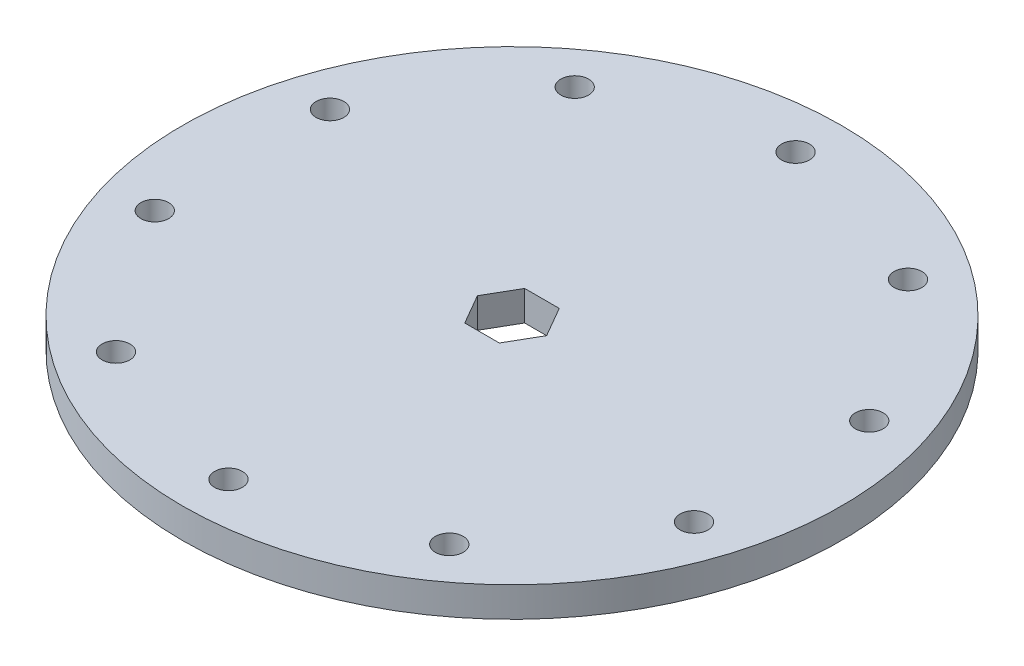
ISO-10303-21;
HEADER;
FILE_DESCRIPTION(('STEP AP214'),'2;1');
FILE_NAME('part.step','',(''),(''),'','','');
FILE_SCHEMA(('AUTOMOTIVE_DESIGN { 1 0 10303 214 1 1 1 1 }'));
ENDSEC;
DATA;
#1=APPLICATION_CONTEXT('core data for automotive mechanical design processes');
#2=APPLICATION_PROTOCOL_DEFINITION('international standard','automotive_design',2000,#1);
#3=PRODUCT_CONTEXT('',#1,'mechanical');
#4=PRODUCT('Part','Part','',(#3));
#5=PRODUCT_RELATED_PRODUCT_CATEGORY('part','',(#4));
#6=PRODUCT_DEFINITION_FORMATION('','',#4);
#7=PRODUCT_DEFINITION_CONTEXT('part definition',#1,'design');
#8=PRODUCT_DEFINITION('design','',#6,#7);
#9=PRODUCT_DEFINITION_SHAPE('','',#8);
#10=(LENGTH_UNIT() NAMED_UNIT(*) SI_UNIT(.MILLI.,.METRE.));
#11=(NAMED_UNIT(*) PLANE_ANGLE_UNIT() SI_UNIT($,.RADIAN.));
#12=(NAMED_UNIT(*) SI_UNIT($,.STERADIAN.) SOLID_ANGLE_UNIT());
#13=UNCERTAINTY_MEASURE_WITH_UNIT(LENGTH_MEASURE(1.E-05),#10,'distance_accuracy_value','');
#14=(GEOMETRIC_REPRESENTATION_CONTEXT(3) GLOBAL_UNCERTAINTY_ASSIGNED_CONTEXT((#13)) GLOBAL_UNIT_ASSIGNED_CONTEXT((#10,
#11,#12)) REPRESENTATION_CONTEXT('',''));
#15=CARTESIAN_POINT('',(0.,0.,0.));
#16=DIRECTION('',(0.,0.,1.));
#17=DIRECTION('',(1.,0.,0.));
#18=AXIS2_PLACEMENT_3D('',#15,#16,#17);
#19=CARTESIAN_POINT('',(0.,3.175,0.));
#20=DIRECTION('',(0.,1.,0.));
#21=DIRECTION('',(0.,0.,1.));
#22=AXIS2_PLACEMENT_3D('',#19,#20,#21);
#23=PLANE('',#22);
#24=CARTESIAN_POINT('',(0.,3.175,-30.0455330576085));
#25=DIRECTION('',(0.,1.,0.));
#26=DIRECTION('',(0.,0.,1.));
#27=AXIS2_PLACEMENT_3D('',#24,#25,#26);
#28=CIRCLE('',#27,1.4732);
#29=CARTESIAN_POINT('',(0.,3.175,-28.5723330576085));
#30=VERTEX_POINT('',#29);
#31=EDGE_CURVE('E319',#30,#30,#28,.T.);
#32=ORIENTED_EDGE('',*,*,#31,.F.);
#33=EDGE_LOOP('',(#32));
#34=FACE_BOUND('',#33,.T.);
#35=CARTESIAN_POINT('',(-17.6603212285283,3.175,-24.3073468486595));
#36=DIRECTION('',(0.,1.,0.));
#37=DIRECTION('',(0.,0.,1.));
#38=AXIS2_PLACEMENT_3D('',#35,#36,#37);
#39=CIRCLE('',#38,1.4732);
#40=CARTESIAN_POINT('',(-17.6603212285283,3.175,-22.8341468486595));
#41=VERTEX_POINT('',#40);
#42=EDGE_CURVE('E321',#41,#41,#39,.T.);
#43=ORIENTED_EDGE('',*,*,#42,.F.);
#44=EDGE_LOOP('',(#43));
#45=FACE_BOUND('',#44,.T.);
#46=CARTESIAN_POINT('',(-28.575,3.175,-9.28458031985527));
#47=DIRECTION('',(0.,1.,0.));
#48=DIRECTION('',(0.,0.,1.));
#49=AXIS2_PLACEMENT_3D('',#46,#47,#48);
#50=CIRCLE('',#49,1.4732);
#51=CARTESIAN_POINT('',(-28.575,3.175,-7.81138031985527));
#52=VERTEX_POINT('',#51);
#53=EDGE_CURVE('E329',#52,#52,#50,.T.);
#54=ORIENTED_EDGE('',*,*,#53,.F.);
#55=EDGE_LOOP('',(#54));
#56=FACE_BOUND('',#55,.T.);
#57=CARTESIAN_POINT('',(-28.575,3.175,9.28458031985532));
#58=DIRECTION('',(0.,1.,0.));
#59=DIRECTION('',(0.,0.,1.));
#60=AXIS2_PLACEMENT_3D('',#57,#58,#59);
#61=CIRCLE('',#60,1.4732);
#62=CARTESIAN_POINT('',(-28.575,3.175,10.7577803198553));
#63=VERTEX_POINT('',#62);
#64=EDGE_CURVE('E335',#63,#63,#61,.T.);
#65=ORIENTED_EDGE('',*,*,#64,.F.);
#66=EDGE_LOOP('',(#65));
#67=FACE_BOUND('',#66,.T.);
#68=CARTESIAN_POINT('',(-17.6603212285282,3.175,24.3073468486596));
#69=DIRECTION('',(0.,1.,0.));
#70=DIRECTION('',(0.,0.,1.));
#71=AXIS2_PLACEMENT_3D('',#68,#69,#70);
#72=CIRCLE('',#71,1.4732);
#73=CARTESIAN_POINT('',(-17.6603212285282,3.175,25.7805468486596));
#74=VERTEX_POINT('',#73);
#75=EDGE_CURVE('E341',#74,#74,#72,.T.);
#76=ORIENTED_EDGE('',*,*,#75,.F.);
#77=EDGE_LOOP('',(#76));
#78=FACE_BOUND('',#77,.T.);
#79=CARTESIAN_POINT('',(0.,3.175,30.0455330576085));
#80=DIRECTION('',(0.,1.,0.));
#81=DIRECTION('',(0.,0.,1.));
#82=AXIS2_PLACEMENT_3D('',#79,#80,#81);
#83=CIRCLE('',#82,1.4732);
#84=CARTESIAN_POINT('',(0.,3.175,31.5187330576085));
#85=VERTEX_POINT('',#84);
#86=EDGE_CURVE('E347',#85,#85,#83,.T.);
#87=ORIENTED_EDGE('',*,*,#86,.F.);
#88=EDGE_LOOP('',(#87));
#89=FACE_BOUND('',#88,.T.);
#90=CARTESIAN_POINT('',(17.6603212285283,3.175,24.3073468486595));
#91=DIRECTION('',(0.,1.,0.));
#92=DIRECTION('',(0.,0.,1.));
#93=AXIS2_PLACEMENT_3D('',#90,#91,#92);
#94=CIRCLE('',#93,1.4732);
#95=CARTESIAN_POINT('',(17.6603212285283,3.175,25.7805468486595));
#96=VERTEX_POINT('',#95);
#97=EDGE_CURVE('E353',#96,#96,#94,.T.);
#98=ORIENTED_EDGE('',*,*,#97,.F.);
#99=EDGE_LOOP('',(#98));
#100=FACE_BOUND('',#99,.T.);
#101=CARTESIAN_POINT('',(28.575,3.175,9.28458031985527));
#102=DIRECTION('',(0.,1.,0.));
#103=DIRECTION('',(0.,0.,1.));
#104=AXIS2_PLACEMENT_3D('',#101,#102,#103);
#105=CIRCLE('',#104,1.4732);
#106=CARTESIAN_POINT('',(28.575,3.175,10.7577803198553));
#107=VERTEX_POINT('',#106);
#108=EDGE_CURVE('E359',#107,#107,#105,.T.);
#109=ORIENTED_EDGE('',*,*,#108,.F.);
#110=EDGE_LOOP('',(#109));
#111=FACE_BOUND('',#110,.T.);
#112=CARTESIAN_POINT('',(28.575,3.175,-9.28458031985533));
#113=DIRECTION('',(0.,1.,0.));
#114=DIRECTION('',(0.,0.,1.));
#115=AXIS2_PLACEMENT_3D('',#112,#113,#114);
#116=CIRCLE('',#115,1.4732);
#117=CARTESIAN_POINT('',(28.575,3.175,-7.81138031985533));
#118=VERTEX_POINT('',#117);
#119=EDGE_CURVE('E365',#118,#118,#116,.T.);
#120=ORIENTED_EDGE('',*,*,#119,.F.);
#121=EDGE_LOOP('',(#120));
#122=FACE_BOUND('',#121,.T.);
#123=CARTESIAN_POINT('',(17.6603212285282,3.175,-24.3073468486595));
#124=DIRECTION('',(0.,1.,0.));
#125=DIRECTION('',(0.,0.,1.));
#126=AXIS2_PLACEMENT_3D('',#123,#124,#125);
#127=CIRCLE('',#126,1.4732);
#128=CARTESIAN_POINT('',(17.6603212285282,3.175,-22.8341468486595));
#129=VERTEX_POINT('',#128);
#130=EDGE_CURVE('E371',#129,#129,#127,.T.);
#131=ORIENTED_EDGE('',*,*,#130,.F.);
#132=EDGE_LOOP('',(#131));
#133=FACE_BOUND('',#132,.T.);
#134=CARTESIAN_POINT('',(0.,3.175,0.));
#135=DIRECTION('',(0.,1.,0.));
#136=DIRECTION('',(0.,0.,1.));
#137=AXIS2_PLACEMENT_3D('',#134,#135,#136);
#138=CIRCLE('',#137,34.925);
#139=CARTESIAN_POINT('',(0.,3.175,34.925));
#140=VERTEX_POINT('',#139);
#141=EDGE_CURVE('E11',#140,#140,#138,.T.);
#142=ORIENTED_EDGE('',*,*,#141,.T.);
#143=EDGE_LOOP('',(#142));
#144=FACE_BOUND('',#143,.T.);
#145=DIRECTION('',(-1.,0.,0.));
#146=VECTOR('',#145,1.);
#147=CARTESIAN_POINT('',(1.83308710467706,3.175,-3.175));
#148=LINE('',#147,#146);
#149=CARTESIAN_POINT('',(1.83308710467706,3.175,-3.175));
#150=VERTEX_POINT('',#149);
#151=CARTESIAN_POINT('',(-1.83308710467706,3.175,-3.175));
#152=VERTEX_POINT('',#151);
#153=EDGE_CURVE('E93',#150,#152,#148,.T.);
#154=ORIENTED_EDGE('',*,*,#153,.F.);
#155=DIRECTION('',(-0.5,0.,-0.866025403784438));
#156=VECTOR('',#155,1.);
#157=CARTESIAN_POINT('',(3.66617420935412,3.175,0.));
#158=LINE('',#157,#156);
#159=CARTESIAN_POINT('',(3.66617420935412,3.175,0.));
#160=VERTEX_POINT('',#159);
#161=EDGE_CURVE('E85',#160,#150,#158,.T.);
#162=ORIENTED_EDGE('',*,*,#161,.F.);
#163=DIRECTION('',(0.5,0.,-0.866025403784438));
#164=VECTOR('',#163,1.);
#165=CARTESIAN_POINT('',(1.83308710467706,3.175,3.175));
#166=LINE('',#165,#164);
#167=CARTESIAN_POINT('',(1.83308710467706,3.175,3.175));
#168=VERTEX_POINT('',#167);
#169=EDGE_CURVE('E114',#168,#160,#166,.T.);
#170=ORIENTED_EDGE('',*,*,#169,.F.);
#171=DIRECTION('',(1.,0.,0.));
#172=VECTOR('',#171,1.);
#173=CARTESIAN_POINT('',(-1.83308710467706,3.175,3.175));
#174=LINE('',#173,#172);
#175=CARTESIAN_POINT('',(-1.83308710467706,3.175,3.175));
#176=VERTEX_POINT('',#175);
#177=EDGE_CURVE('E112',#176,#168,#174,.T.);
#178=ORIENTED_EDGE('',*,*,#177,.F.);
#179=DIRECTION('',(0.5,0.,0.866025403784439));
#180=VECTOR('',#179,1.);
#181=CARTESIAN_POINT('',(-3.66617420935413,3.175,0.));
#182=LINE('',#181,#180);
#183=CARTESIAN_POINT('',(-3.66617420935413,3.175,0.));
#184=VERTEX_POINT('',#183);
#185=EDGE_CURVE('E107',#184,#176,#182,.T.);
#186=ORIENTED_EDGE('',*,*,#185,.F.);
#187=DIRECTION('',(-0.5,0.,0.866025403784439));
#188=VECTOR('',#187,1.);
#189=CARTESIAN_POINT('',(-1.83308710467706,3.175,-3.175));
#190=LINE('',#189,#188);
#191=EDGE_CURVE('E105',#152,#184,#190,.T.);
#192=ORIENTED_EDGE('',*,*,#191,.F.);
#193=EDGE_LOOP('',(#154,#162,#170,#178,#186,#192));
#194=FACE_BOUND('',#193,.T.);
#195=ADVANCED_FACE('F32',(#34,#45,#56,#67,#78,#89,#100,#111,#122,#133,#144,#194),#23,.T.);
#196=CARTESIAN_POINT('',(0.,0.,0.));
#197=DIRECTION('',(0.,1.,0.));
#198=DIRECTION('',(0.,0.,1.));
#199=AXIS2_PLACEMENT_3D('',#196,#197,#198);
#200=PLANE('',#199);
#201=CARTESIAN_POINT('',(0.,0.,-30.0455330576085));
#202=DIRECTION('',(0.,1.,0.));
#203=DIRECTION('',(0.,0.,1.));
#204=AXIS2_PLACEMENT_3D('',#201,#202,#203);
#205=CIRCLE('',#204,1.4732);
#206=CARTESIAN_POINT('',(0.,0.,-28.5723330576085));
#207=VERTEX_POINT('',#206);
#208=EDGE_CURVE('E317',#207,#207,#205,.T.);
#209=ORIENTED_EDGE('',*,*,#208,.T.);
#210=EDGE_LOOP('',(#209));
#211=FACE_BOUND('',#210,.T.);
#212=CARTESIAN_POINT('',(-17.6603212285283,0.,-24.3073468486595));
#213=DIRECTION('',(0.,1.,0.));
#214=DIRECTION('',(0.,0.,1.));
#215=AXIS2_PLACEMENT_3D('',#212,#213,#214);
#216=CIRCLE('',#215,1.4732);
#217=CARTESIAN_POINT('',(-17.6603212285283,0.,-22.8341468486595));
#218=VERTEX_POINT('',#217);
#219=EDGE_CURVE('E326',#218,#218,#216,.T.);
#220=ORIENTED_EDGE('',*,*,#219,.T.);
#221=EDGE_LOOP('',(#220));
#222=FACE_BOUND('',#221,.T.);
#223=CARTESIAN_POINT('',(-28.575,0.,-9.28458031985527));
#224=DIRECTION('',(0.,1.,0.));
#225=DIRECTION('',(0.,0.,1.));
#226=AXIS2_PLACEMENT_3D('',#223,#224,#225);
#227=CIRCLE('',#226,1.4732);
#228=CARTESIAN_POINT('',(-28.575,0.,-7.81138031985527));
#229=VERTEX_POINT('',#228);
#230=EDGE_CURVE('E332',#229,#229,#227,.T.);
#231=ORIENTED_EDGE('',*,*,#230,.T.);
#232=EDGE_LOOP('',(#231));
#233=FACE_BOUND('',#232,.T.);
#234=CARTESIAN_POINT('',(-28.575,0.,9.28458031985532));
#235=DIRECTION('',(0.,1.,0.));
#236=DIRECTION('',(0.,0.,1.));
#237=AXIS2_PLACEMENT_3D('',#234,#235,#236);
#238=CIRCLE('',#237,1.4732);
#239=CARTESIAN_POINT('',(-28.575,0.,10.7577803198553));
#240=VERTEX_POINT('',#239);
#241=EDGE_CURVE('E338',#240,#240,#238,.T.);
#242=ORIENTED_EDGE('',*,*,#241,.T.);
#243=EDGE_LOOP('',(#242));
#244=FACE_BOUND('',#243,.T.);
#245=CARTESIAN_POINT('',(-17.6603212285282,0.,24.3073468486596));
#246=DIRECTION('',(0.,1.,0.));
#247=DIRECTION('',(0.,0.,1.));
#248=AXIS2_PLACEMENT_3D('',#245,#246,#247);
#249=CIRCLE('',#248,1.4732);
#250=CARTESIAN_POINT('',(-17.6603212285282,0.,25.7805468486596));
#251=VERTEX_POINT('',#250);
#252=EDGE_CURVE('E344',#251,#251,#249,.T.);
#253=ORIENTED_EDGE('',*,*,#252,.T.);
#254=EDGE_LOOP('',(#253));
#255=FACE_BOUND('',#254,.T.);
#256=CARTESIAN_POINT('',(0.,0.,30.0455330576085));
#257=DIRECTION('',(0.,1.,0.));
#258=DIRECTION('',(0.,0.,1.));
#259=AXIS2_PLACEMENT_3D('',#256,#257,#258);
#260=CIRCLE('',#259,1.4732);
#261=CARTESIAN_POINT('',(0.,0.,31.5187330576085));
#262=VERTEX_POINT('',#261);
#263=EDGE_CURVE('E350',#262,#262,#260,.T.);
#264=ORIENTED_EDGE('',*,*,#263,.T.);
#265=EDGE_LOOP('',(#264));
#266=FACE_BOUND('',#265,.T.);
#267=CARTESIAN_POINT('',(17.6603212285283,0.,24.3073468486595));
#268=DIRECTION('',(0.,1.,0.));
#269=DIRECTION('',(0.,0.,1.));
#270=AXIS2_PLACEMENT_3D('',#267,#268,#269);
#271=CIRCLE('',#270,1.4732);
#272=CARTESIAN_POINT('',(17.6603212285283,0.,25.7805468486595));
#273=VERTEX_POINT('',#272);
#274=EDGE_CURVE('E356',#273,#273,#271,.T.);
#275=ORIENTED_EDGE('',*,*,#274,.T.);
#276=EDGE_LOOP('',(#275));
#277=FACE_BOUND('',#276,.T.);
#278=CARTESIAN_POINT('',(28.575,0.,9.28458031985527));
#279=DIRECTION('',(0.,1.,0.));
#280=DIRECTION('',(0.,0.,1.));
#281=AXIS2_PLACEMENT_3D('',#278,#279,#280);
#282=CIRCLE('',#281,1.4732);
#283=CARTESIAN_POINT('',(28.575,0.,10.7577803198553));
#284=VERTEX_POINT('',#283);
#285=EDGE_CURVE('E362',#284,#284,#282,.T.);
#286=ORIENTED_EDGE('',*,*,#285,.T.);
#287=EDGE_LOOP('',(#286));
#288=FACE_BOUND('',#287,.T.);
#289=CARTESIAN_POINT('',(28.575,0.,-9.28458031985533));
#290=DIRECTION('',(0.,1.,0.));
#291=DIRECTION('',(0.,0.,1.));
#292=AXIS2_PLACEMENT_3D('',#289,#290,#291);
#293=CIRCLE('',#292,1.4732);
#294=CARTESIAN_POINT('',(28.575,0.,-7.81138031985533));
#295=VERTEX_POINT('',#294);
#296=EDGE_CURVE('E368',#295,#295,#293,.T.);
#297=ORIENTED_EDGE('',*,*,#296,.T.);
#298=EDGE_LOOP('',(#297));
#299=FACE_BOUND('',#298,.T.);
#300=CARTESIAN_POINT('',(17.6603212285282,0.,-24.3073468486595));
#301=DIRECTION('',(0.,1.,0.));
#302=DIRECTION('',(0.,0.,1.));
#303=AXIS2_PLACEMENT_3D('',#300,#301,#302);
#304=CIRCLE('',#303,1.4732);
#305=CARTESIAN_POINT('',(17.6603212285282,0.,-22.8341468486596));
#306=VERTEX_POINT('',#305);
#307=EDGE_CURVE('E117',#306,#306,#304,.T.);
#308=ORIENTED_EDGE('',*,*,#307,.T.);
#309=EDGE_LOOP('',(#308));
#310=FACE_BOUND('',#309,.T.);
#311=CARTESIAN_POINT('',(0.,0.,0.));
#312=DIRECTION('',(0.,1.,0.));
#313=DIRECTION('',(0.,0.,1.));
#314=AXIS2_PLACEMENT_3D('',#311,#312,#313);
#315=CIRCLE('',#314,34.925);
#316=CARTESIAN_POINT('',(0.,0.,34.925));
#317=VERTEX_POINT('',#316);
#318=EDGE_CURVE('E36',#317,#317,#315,.T.);
#319=ORIENTED_EDGE('',*,*,#318,.F.);
#320=EDGE_LOOP('',(#319));
#321=FACE_BOUND('',#320,.T.);
#322=DIRECTION('',(-0.5,0.,-0.866025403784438));
#323=VECTOR('',#322,1.);
#324=CARTESIAN_POINT('',(3.66617420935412,0.,0.));
#325=LINE('',#324,#323);
#326=CARTESIAN_POINT('',(3.66617420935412,0.,0.));
#327=VERTEX_POINT('',#326);
#328=CARTESIAN_POINT('',(1.83308710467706,0.,-3.175));
#329=VERTEX_POINT('',#328);
#330=EDGE_CURVE('E55',#327,#329,#325,.T.);
#331=ORIENTED_EDGE('',*,*,#330,.T.);
#332=DIRECTION('',(-1.,0.,0.));
#333=VECTOR('',#332,1.);
#334=CARTESIAN_POINT('',(1.83308710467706,0.,-3.175));
#335=LINE('',#334,#333);
#336=CARTESIAN_POINT('',(-1.83308710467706,0.,-3.175));
#337=VERTEX_POINT('',#336);
#338=EDGE_CURVE('E100',#329,#337,#335,.T.);
#339=ORIENTED_EDGE('',*,*,#338,.T.);
#340=DIRECTION('',(-0.5,0.,0.866025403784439));
#341=VECTOR('',#340,1.);
#342=CARTESIAN_POINT('',(-1.83308710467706,0.,-3.175));
#343=LINE('',#342,#341);
#344=CARTESIAN_POINT('',(-3.66617420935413,0.,0.));
#345=VERTEX_POINT('',#344);
#346=EDGE_CURVE('E119',#337,#345,#343,.T.);
#347=ORIENTED_EDGE('',*,*,#346,.T.);
#348=DIRECTION('',(0.5,0.,0.866025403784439));
#349=VECTOR('',#348,1.);
#350=CARTESIAN_POINT('',(-3.66617420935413,0.,0.));
#351=LINE('',#350,#349);
#352=CARTESIAN_POINT('',(-1.83308710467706,0.,3.175));
#353=VERTEX_POINT('',#352);
#354=EDGE_CURVE('E122',#345,#353,#351,.T.);
#355=ORIENTED_EDGE('',*,*,#354,.T.);
#356=DIRECTION('',(1.,0.,0.));
#357=VECTOR('',#356,1.);
#358=CARTESIAN_POINT('',(-1.83308710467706,0.,3.175));
#359=LINE('',#358,#357);
#360=CARTESIAN_POINT('',(1.83308710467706,0.,3.175));
#361=VERTEX_POINT('',#360);
#362=EDGE_CURVE('E125',#353,#361,#359,.T.);
#363=ORIENTED_EDGE('',*,*,#362,.T.);
#364=DIRECTION('',(0.5,0.,-0.866025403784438));
#365=VECTOR('',#364,1.);
#366=CARTESIAN_POINT('',(1.83308710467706,0.,3.175));
#367=LINE('',#366,#365);
#368=EDGE_CURVE('E94',#361,#327,#367,.T.);
#369=ORIENTED_EDGE('',*,*,#368,.T.);
#370=EDGE_LOOP('',(#331,#339,#347,#355,#363,#369));
#371=FACE_BOUND('',#370,.T.);
#372=ADVANCED_FACE('F142',(#211,#222,#233,#244,#255,#266,#277,#288,#299,#310,#321,#371),#200,.F.);
#373=CARTESIAN_POINT('',(0.,3.175,0.));
#374=DIRECTION('',(0.,-1.,0.));
#375=DIRECTION('',(0.,0.,-1.));
#376=AXIS2_PLACEMENT_3D('',#373,#374,#375);
#377=CYLINDRICAL_SURFACE('',#376,34.925);
#378=ORIENTED_EDGE('',*,*,#141,.F.);
#379=EDGE_LOOP('',(#378));
#380=FACE_BOUND('',#379,.T.);
#381=ORIENTED_EDGE('',*,*,#318,.T.);
#382=EDGE_LOOP('',(#381));
#383=FACE_BOUND('',#382,.T.);
#384=ADVANCED_FACE('F34',(#380,#383),#377,.T.);
#385=CARTESIAN_POINT('',(3.66617420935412,3.175,0.));
#386=DIRECTION('',(-0.866025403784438,0.,0.5));
#387=DIRECTION('',(0.500000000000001,0.,0.866025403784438));
#388=AXIS2_PLACEMENT_3D('',#385,#386,#387);
#389=PLANE('',#388);
#390=ORIENTED_EDGE('',*,*,#330,.F.);
#391=DIRECTION('',(0.,-1.,0.));
#392=VECTOR('',#391,1.);
#393=CARTESIAN_POINT('',(3.66617420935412,3.175,0.));
#394=LINE('',#393,#392);
#395=EDGE_CURVE('E89',#160,#327,#394,.T.);
#396=ORIENTED_EDGE('',*,*,#395,.F.);
#397=ORIENTED_EDGE('',*,*,#161,.T.);
#398=DIRECTION('',(0.,-1.,0.));
#399=VECTOR('',#398,1.);
#400=CARTESIAN_POINT('',(1.83308710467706,3.175,-3.175));
#401=LINE('',#400,#399);
#402=EDGE_CURVE('E88',#150,#329,#401,.T.);
#403=ORIENTED_EDGE('',*,*,#402,.T.);
#404=EDGE_LOOP('',(#390,#396,#397,#403));
#405=FACE_BOUND('',#404,.T.);
#406=ADVANCED_FACE('F87',(#405),#389,.T.);
#407=CARTESIAN_POINT('',(1.83308710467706,3.175,-3.175));
#408=DIRECTION('',(0.,0.,1.));
#409=DIRECTION('',(1.,0.,0.));
#410=AXIS2_PLACEMENT_3D('',#407,#408,#409);
#411=PLANE('',#410);
#412=ORIENTED_EDGE('',*,*,#338,.F.);
#413=ORIENTED_EDGE('',*,*,#402,.F.);
#414=ORIENTED_EDGE('',*,*,#153,.T.);
#415=DIRECTION('',(0.,-1.,0.));
#416=VECTOR('',#415,1.);
#417=CARTESIAN_POINT('',(-1.83308710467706,3.175,-3.175));
#418=LINE('',#417,#416);
#419=EDGE_CURVE('E101',#152,#337,#418,.T.);
#420=ORIENTED_EDGE('',*,*,#419,.T.);
#421=EDGE_LOOP('',(#412,#413,#414,#420));
#422=FACE_BOUND('',#421,.T.);
#423=ADVANCED_FACE('F97',(#422),#411,.T.);
#424=CARTESIAN_POINT('',(-1.83308710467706,3.175,-3.175));
#425=DIRECTION('',(0.866025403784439,0.,0.5));
#426=DIRECTION('',(0.5,0.,-0.866025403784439));
#427=AXIS2_PLACEMENT_3D('',#424,#425,#426);
#428=PLANE('',#427);
#429=ORIENTED_EDGE('',*,*,#346,.F.);
#430=ORIENTED_EDGE('',*,*,#419,.F.);
#431=ORIENTED_EDGE('',*,*,#191,.T.);
#432=DIRECTION('',(0.,-1.,0.));
#433=VECTOR('',#432,1.);
#434=CARTESIAN_POINT('',(-3.66617420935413,3.175,0.));
#435=LINE('',#434,#433);
#436=EDGE_CURVE('E134',#184,#345,#435,.T.);
#437=ORIENTED_EDGE('',*,*,#436,.T.);
#438=EDGE_LOOP('',(#429,#430,#431,#437));
#439=FACE_BOUND('',#438,.T.);
#440=ADVANCED_FACE('F138',(#439),#428,.T.);
#441=CARTESIAN_POINT('',(-3.66617420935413,3.175,0.));
#442=DIRECTION('',(0.866025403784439,0.,-0.5));
#443=DIRECTION('',(-0.5,0.,-0.866025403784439));
#444=AXIS2_PLACEMENT_3D('',#441,#442,#443);
#445=PLANE('',#444);
#446=ORIENTED_EDGE('',*,*,#354,.F.);
#447=ORIENTED_EDGE('',*,*,#436,.F.);
#448=ORIENTED_EDGE('',*,*,#185,.T.);
#449=DIRECTION('',(0.,-1.,0.));
#450=VECTOR('',#449,1.);
#451=CARTESIAN_POINT('',(-1.83308710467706,3.175,3.175));
#452=LINE('',#451,#450);
#453=EDGE_CURVE('E132',#176,#353,#452,.T.);
#454=ORIENTED_EDGE('',*,*,#453,.T.);
#455=EDGE_LOOP('',(#446,#447,#448,#454));
#456=FACE_BOUND('',#455,.T.);
#457=ADVANCED_FACE('F150',(#456),#445,.T.);
#458=CARTESIAN_POINT('',(-1.83308710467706,3.175,3.175));
#459=DIRECTION('',(0.,0.,-1.));
#460=DIRECTION('',(-1.,0.,0.));
#461=AXIS2_PLACEMENT_3D('',#458,#459,#460);
#462=PLANE('',#461);
#463=ORIENTED_EDGE('',*,*,#362,.F.);
#464=ORIENTED_EDGE('',*,*,#453,.F.);
#465=ORIENTED_EDGE('',*,*,#177,.T.);
#466=DIRECTION('',(0.,-1.,0.));
#467=VECTOR('',#466,1.);
#468=CARTESIAN_POINT('',(1.83308710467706,3.175,3.175));
#469=LINE('',#468,#467);
#470=EDGE_CURVE('E47',#168,#361,#469,.T.);
#471=ORIENTED_EDGE('',*,*,#470,.T.);
#472=EDGE_LOOP('',(#463,#464,#465,#471));
#473=FACE_BOUND('',#472,.T.);
#474=ADVANCED_FACE('F148',(#473),#462,.T.);
#475=CARTESIAN_POINT('',(1.83308710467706,3.175,3.175));
#476=DIRECTION('',(-0.866025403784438,0.,-0.5));
#477=DIRECTION('',(-0.5,0.,0.866025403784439));
#478=AXIS2_PLACEMENT_3D('',#475,#476,#477);
#479=PLANE('',#478);
#480=ORIENTED_EDGE('',*,*,#368,.F.);
#481=ORIENTED_EDGE('',*,*,#470,.F.);
#482=ORIENTED_EDGE('',*,*,#169,.T.);
#483=ORIENTED_EDGE('',*,*,#395,.T.);
#484=EDGE_LOOP('',(#480,#481,#482,#483));
#485=FACE_BOUND('',#484,.T.);
#486=ADVANCED_FACE('F144',(#485),#479,.T.);
#487=CARTESIAN_POINT('',(17.6603212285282,3.175,-24.3073468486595));
#488=DIRECTION('',(0.,1.,0.));
#489=DIRECTION('',(0.,0.,1.));
#490=AXIS2_PLACEMENT_3D('',#487,#488,#489);
#491=CYLINDRICAL_SURFACE('',#490,1.4732);
#492=ORIENTED_EDGE('',*,*,#307,.F.);
#493=EDGE_LOOP('',(#492));
#494=FACE_BOUND('',#493,.T.);
#495=ORIENTED_EDGE('',*,*,#130,.T.);
#496=EDGE_LOOP('',(#495));
#497=FACE_BOUND('',#496,.T.);
#498=ADVANCED_FACE('F199',(#494,#497),#491,.F.);
#499=CARTESIAN_POINT('',(28.575,3.175,-9.28458031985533));
#500=DIRECTION('',(0.,1.,0.));
#501=DIRECTION('',(0.,0.,1.));
#502=AXIS2_PLACEMENT_3D('',#499,#500,#501);
#503=CYLINDRICAL_SURFACE('',#502,1.4732);
#504=ORIENTED_EDGE('',*,*,#296,.F.);
#505=EDGE_LOOP('',(#504));
#506=FACE_BOUND('',#505,.T.);
#507=ORIENTED_EDGE('',*,*,#119,.T.);
#508=EDGE_LOOP('',(#507));
#509=FACE_BOUND('',#508,.T.);
#510=ADVANCED_FACE('F220',(#506,#509),#503,.F.);
#511=CARTESIAN_POINT('',(28.575,3.175,9.28458031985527));
#512=DIRECTION('',(0.,1.,0.));
#513=DIRECTION('',(0.,0.,1.));
#514=AXIS2_PLACEMENT_3D('',#511,#512,#513);
#515=CYLINDRICAL_SURFACE('',#514,1.4732);
#516=ORIENTED_EDGE('',*,*,#285,.F.);
#517=EDGE_LOOP('',(#516));
#518=FACE_BOUND('',#517,.T.);
#519=ORIENTED_EDGE('',*,*,#108,.T.);
#520=EDGE_LOOP('',(#519));
#521=FACE_BOUND('',#520,.T.);
#522=ADVANCED_FACE('F230',(#518,#521),#515,.F.);
#523=CARTESIAN_POINT('',(17.6603212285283,3.175,24.3073468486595));
#524=DIRECTION('',(0.,1.,0.));
#525=DIRECTION('',(0.,0.,1.));
#526=AXIS2_PLACEMENT_3D('',#523,#524,#525);
#527=CYLINDRICAL_SURFACE('',#526,1.4732);
#528=ORIENTED_EDGE('',*,*,#274,.F.);
#529=EDGE_LOOP('',(#528));
#530=FACE_BOUND('',#529,.T.);
#531=ORIENTED_EDGE('',*,*,#97,.T.);
#532=EDGE_LOOP('',(#531));
#533=FACE_BOUND('',#532,.T.);
#534=ADVANCED_FACE('F240',(#530,#533),#527,.F.);
#535=CARTESIAN_POINT('',(0.,3.175,30.0455330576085));
#536=DIRECTION('',(0.,1.,0.));
#537=DIRECTION('',(0.,0.,1.));
#538=AXIS2_PLACEMENT_3D('',#535,#536,#537);
#539=CYLINDRICAL_SURFACE('',#538,1.4732);
#540=ORIENTED_EDGE('',*,*,#263,.F.);
#541=EDGE_LOOP('',(#540));
#542=FACE_BOUND('',#541,.T.);
#543=ORIENTED_EDGE('',*,*,#86,.T.);
#544=EDGE_LOOP('',(#543));
#545=FACE_BOUND('',#544,.T.);
#546=ADVANCED_FACE('F250',(#542,#545),#539,.F.);
#547=CARTESIAN_POINT('',(-17.6603212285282,3.175,24.3073468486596));
#548=DIRECTION('',(0.,1.,0.));
#549=DIRECTION('',(0.,0.,1.));
#550=AXIS2_PLACEMENT_3D('',#547,#548,#549);
#551=CYLINDRICAL_SURFACE('',#550,1.4732);
#552=ORIENTED_EDGE('',*,*,#252,.F.);
#553=EDGE_LOOP('',(#552));
#554=FACE_BOUND('',#553,.T.);
#555=ORIENTED_EDGE('',*,*,#75,.T.);
#556=EDGE_LOOP('',(#555));
#557=FACE_BOUND('',#556,.T.);
#558=ADVANCED_FACE('F260',(#554,#557),#551,.F.);
#559=CARTESIAN_POINT('',(-28.575,3.175,9.28458031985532));
#560=DIRECTION('',(0.,1.,0.));
#561=DIRECTION('',(0.,0.,1.));
#562=AXIS2_PLACEMENT_3D('',#559,#560,#561);
#563=CYLINDRICAL_SURFACE('',#562,1.4732);
#564=ORIENTED_EDGE('',*,*,#241,.F.);
#565=EDGE_LOOP('',(#564));
#566=FACE_BOUND('',#565,.T.);
#567=ORIENTED_EDGE('',*,*,#64,.T.);
#568=EDGE_LOOP('',(#567));
#569=FACE_BOUND('',#568,.T.);
#570=ADVANCED_FACE('F270',(#566,#569),#563,.F.);
#571=CARTESIAN_POINT('',(-28.575,3.175,-9.28458031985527));
#572=DIRECTION('',(0.,1.,0.));
#573=DIRECTION('',(0.,0.,1.));
#574=AXIS2_PLACEMENT_3D('',#571,#572,#573);
#575=CYLINDRICAL_SURFACE('',#574,1.4732);
#576=ORIENTED_EDGE('',*,*,#230,.F.);
#577=EDGE_LOOP('',(#576));
#578=FACE_BOUND('',#577,.T.);
#579=ORIENTED_EDGE('',*,*,#53,.T.);
#580=EDGE_LOOP('',(#579));
#581=FACE_BOUND('',#580,.T.);
#582=ADVANCED_FACE('F280',(#578,#581),#575,.F.);
#583=CARTESIAN_POINT('',(-17.6603212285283,3.175,-24.3073468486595));
#584=DIRECTION('',(0.,1.,0.));
#585=DIRECTION('',(0.,0.,1.));
#586=AXIS2_PLACEMENT_3D('',#583,#584,#585);
#587=CYLINDRICAL_SURFACE('',#586,1.4732);
#588=ORIENTED_EDGE('',*,*,#219,.F.);
#589=EDGE_LOOP('',(#588));
#590=FACE_BOUND('',#589,.T.);
#591=ORIENTED_EDGE('',*,*,#42,.T.);
#592=EDGE_LOOP('',(#591));
#593=FACE_BOUND('',#592,.T.);
#594=ADVANCED_FACE('F290',(#590,#593),#587,.F.);
#595=CARTESIAN_POINT('',(0.,3.175,-30.0455330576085));
#596=DIRECTION('',(0.,1.,0.));
#597=DIRECTION('',(0.,0.,1.));
#598=AXIS2_PLACEMENT_3D('',#595,#596,#597);
#599=CYLINDRICAL_SURFACE('',#598,1.4732);
#600=ORIENTED_EDGE('',*,*,#208,.F.);
#601=EDGE_LOOP('',(#600));
#602=FACE_BOUND('',#601,.T.);
#603=ORIENTED_EDGE('',*,*,#31,.T.);
#604=EDGE_LOOP('',(#603));
#605=FACE_BOUND('',#604,.T.);
#606=ADVANCED_FACE('F300',(#602,#605),#599,.F.);
#607=CLOSED_SHELL('',(#195,#372,#384,#406,#423,#440,#457,#474,#486,#498,#510,#522,#534,#546,
#558,#570,#582,#594,#606));
#608=MANIFOLD_SOLID_BREP('B2',#607);
#609=ADVANCED_BREP_SHAPE_REPRESENTATION('',(#18,#608),#14);
#610=SHAPE_DEFINITION_REPRESENTATION(#9,#609);
ENDSEC;
END-ISO-10303-21;
